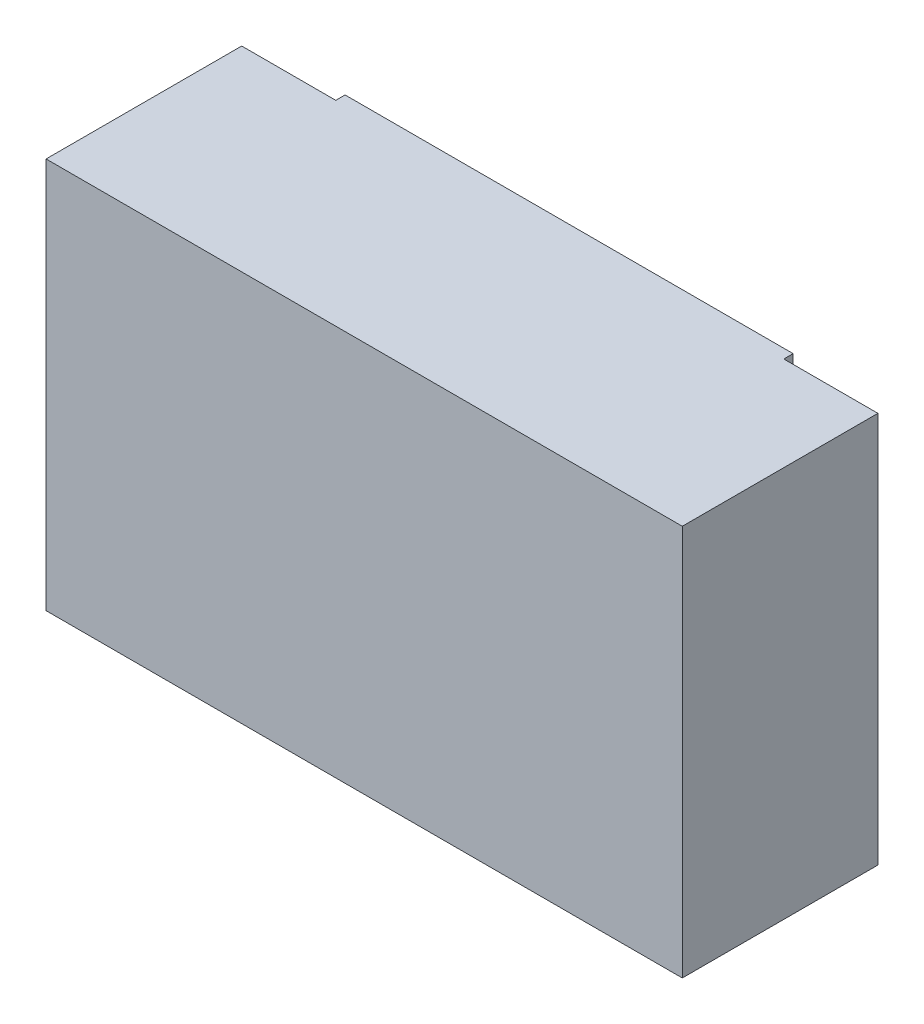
ISO-10303-21;
HEADER;
FILE_DESCRIPTION(('STEP AP214'),'2;1');
FILE_NAME('part.step','',(''),(''),'','','');
FILE_SCHEMA(('AUTOMOTIVE_DESIGN { 1 0 10303 214 1 1 1 1 }'));
ENDSEC;
DATA;
#1=APPLICATION_CONTEXT('core data for automotive mechanical design processes');
#2=APPLICATION_PROTOCOL_DEFINITION('international standard','automotive_design',2000,#1);
#3=PRODUCT_CONTEXT('',#1,'mechanical');
#4=PRODUCT('Part','Part','',(#3));
#5=PRODUCT_RELATED_PRODUCT_CATEGORY('part','',(#4));
#6=PRODUCT_DEFINITION_FORMATION('','',#4);
#7=PRODUCT_DEFINITION_CONTEXT('part definition',#1,'design');
#8=PRODUCT_DEFINITION('design','',#6,#7);
#9=PRODUCT_DEFINITION_SHAPE('','',#8);
#10=(LENGTH_UNIT() NAMED_UNIT(*) SI_UNIT(.MILLI.,.METRE.));
#11=(NAMED_UNIT(*) PLANE_ANGLE_UNIT() SI_UNIT($,.RADIAN.));
#12=(NAMED_UNIT(*) SI_UNIT($,.STERADIAN.) SOLID_ANGLE_UNIT());
#13=UNCERTAINTY_MEASURE_WITH_UNIT(LENGTH_MEASURE(1.E-05),#10,'distance_accuracy_value','');
#14=(GEOMETRIC_REPRESENTATION_CONTEXT(3) GLOBAL_UNCERTAINTY_ASSIGNED_CONTEXT((#13)) GLOBAL_UNIT_ASSIGNED_CONTEXT((#10,
#11,#12)) REPRESENTATION_CONTEXT('',''));
#15=CARTESIAN_POINT('',(0.,0.,0.));
#16=DIRECTION('',(0.,0.,1.));
#17=DIRECTION('',(1.,0.,0.));
#18=AXIS2_PLACEMENT_3D('',#15,#16,#17);
#19=CARTESIAN_POINT('',(35.092858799,-7.828970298,1.));
#20=DIRECTION('',(0.,0.,-1.));
#21=DIRECTION('',(-1.,0.,0.));
#22=AXIS2_PLACEMENT_3D('',#19,#20,#21);
#23=PLANE('',#22);
#24=DIRECTION('',(1.,0.,0.));
#25=VECTOR('',#24,1.);
#26=CARTESIAN_POINT('',(0.9428587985,34.171029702,0.999999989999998));
#27=LINE('',#26,#25);
#28=CARTESIAN_POINT('',(24.992858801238,34.171029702,0.999999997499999));
#29=VERTEX_POINT('',#28);
#30=CARTESIAN_POINT('',(35.092858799,34.171029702,0.9999999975));
#31=VERTEX_POINT('',#30);
#32=EDGE_CURVE('E90',#29,#31,#27,.T.);
#33=ORIENTED_EDGE('',*,*,#32,.T.);
#34=DIRECTION('',(0.,1.,0.));
#35=VECTOR('',#34,1.);
#36=CARTESIAN_POINT('',(35.092858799,13.171029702,1.));
#37=LINE('',#36,#35);
#38=CARTESIAN_POINT('',(35.092858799,-7.828970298,0.9999999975));
#39=VERTEX_POINT('',#38);
#40=EDGE_CURVE('E82',#39,#31,#37,.T.);
#41=ORIENTED_EDGE('',*,*,#40,.F.);
#42=DIRECTION('',(1.,0.,0.));
#43=VECTOR('',#42,1.);
#44=CARTESIAN_POINT('',(0.9428587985,-7.828970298,0.999999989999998));
#45=LINE('',#44,#43);
#46=CARTESIAN_POINT('',(24.992858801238,-7.828970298,0.999999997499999));
#47=VERTEX_POINT('',#46);
#48=EDGE_CURVE('E91',#47,#39,#45,.T.);
#49=ORIENTED_EDGE('',*,*,#48,.F.);
#50=DIRECTION('',(0.,-1.,0.));
#51=VECTOR('',#50,1.);
#52=CARTESIAN_POINT('',(24.992858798,13.171029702,1.));
#53=LINE('',#52,#51);
#54=EDGE_CURVE('E88',#29,#47,#53,.T.);
#55=ORIENTED_EDGE('',*,*,#54,.F.);
#56=EDGE_LOOP('',(#33,#41,#49,#55));
#57=FACE_BOUND('',#56,.T.);
#58=ADVANCED_FACE('F17',(#57),#23,.T.);
#59=CARTESIAN_POINT('',(35.092858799,-7.828970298,22.));
#60=DIRECTION('',(1.,0.,0.));
#61=DIRECTION('',(0.,0.,-1.));
#62=AXIS2_PLACEMENT_3D('',#59,#60,#61);
#63=PLANE('',#62);
#64=DIRECTION('',(0.,0.,1.));
#65=VECTOR('',#64,1.);
#66=CARTESIAN_POINT('',(35.092858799,34.171029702,11.));
#67=LINE('',#66,#65);
#68=CARTESIAN_POINT('',(35.092858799,34.171029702,22.));
#69=VERTEX_POINT('',#68);
#70=EDGE_CURVE('E105',#31,#69,#67,.T.);
#71=ORIENTED_EDGE('',*,*,#70,.T.);
#72=DIRECTION('',(0.,1.,0.));
#73=VECTOR('',#72,1.);
#74=CARTESIAN_POINT('',(35.092858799,13.171029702,22.));
#75=LINE('',#74,#73);
#76=CARTESIAN_POINT('',(35.092858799,-7.828970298,22.));
#77=VERTEX_POINT('',#76);
#78=EDGE_CURVE('E117',#77,#69,#75,.T.);
#79=ORIENTED_EDGE('',*,*,#78,.F.);
#80=DIRECTION('',(0.,0.,1.));
#81=VECTOR('',#80,1.);
#82=CARTESIAN_POINT('',(35.092858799,-7.828970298,11.));
#83=LINE('',#82,#81);
#84=EDGE_CURVE('E151',#39,#77,#83,.T.);
#85=ORIENTED_EDGE('',*,*,#84,.F.);
#86=ORIENTED_EDGE('',*,*,#40,.T.);
#87=EDGE_LOOP('',(#71,#79,#85,#86));
#88=FACE_BOUND('',#87,.T.);
#89=ADVANCED_FACE('F169',(#88),#63,.T.);
#90=CARTESIAN_POINT('',(-33.207141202,-7.828970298,22.));
#91=DIRECTION('',(0.,0.,1.));
#92=DIRECTION('',(1.,0.,0.));
#93=AXIS2_PLACEMENT_3D('',#90,#91,#92);
#94=PLANE('',#93);
#95=DIRECTION('',(-1.,0.,0.));
#96=VECTOR('',#95,1.);
#97=CARTESIAN_POINT('',(0.9428587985,-7.828970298,22.));
#98=LINE('',#97,#96);
#99=CARTESIAN_POINT('',(-33.207141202,-7.828970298,22.));
#100=VERTEX_POINT('',#99);
#101=EDGE_CURVE('E145',#77,#100,#98,.T.);
#102=ORIENTED_EDGE('',*,*,#101,.F.);
#103=ORIENTED_EDGE('',*,*,#78,.T.);
#104=DIRECTION('',(-1.,0.,0.));
#105=VECTOR('',#104,1.);
#106=CARTESIAN_POINT('',(0.9428587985,34.171029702,22.));
#107=LINE('',#106,#105);
#108=CARTESIAN_POINT('',(-33.207141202,34.171029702,22.));
#109=VERTEX_POINT('',#108);
#110=EDGE_CURVE('E166',#69,#109,#107,.T.);
#111=ORIENTED_EDGE('',*,*,#110,.T.);
#112=DIRECTION('',(0.,-1.,0.));
#113=VECTOR('',#112,1.);
#114=CARTESIAN_POINT('',(-33.207141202,13.171029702,22.));
#115=LINE('',#114,#113);
#116=EDGE_CURVE('E114',#109,#100,#115,.T.);
#117=ORIENTED_EDGE('',*,*,#116,.T.);
#118=EDGE_LOOP('',(#102,#103,#111,#117));
#119=FACE_BOUND('',#118,.T.);
#120=ADVANCED_FACE('F172',(#119),#94,.T.);
#121=CARTESIAN_POINT('',(-33.207141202,-7.828970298,22.));
#122=DIRECTION('',(1.,0.,0.));
#123=DIRECTION('',(0.,0.,-1.));
#124=AXIS2_PLACEMENT_3D('',#121,#122,#123);
#125=PLANE('',#124);
#126=DIRECTION('',(0.,0.,-1.));
#127=VECTOR('',#126,1.);
#128=CARTESIAN_POINT('',(-33.207141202,-7.828970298,11.));
#129=LINE('',#128,#127);
#130=CARTESIAN_POINT('',(-33.207141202,-7.828970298,0.9999999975));
#131=VERTEX_POINT('',#130);
#132=EDGE_CURVE('E142',#100,#131,#129,.T.);
#133=ORIENTED_EDGE('',*,*,#132,.F.);
#134=ORIENTED_EDGE('',*,*,#116,.F.);
#135=DIRECTION('',(0.,0.,-1.));
#136=VECTOR('',#135,1.);
#137=CARTESIAN_POINT('',(-33.207141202,34.171029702,11.));
#138=LINE('',#137,#136);
#139=CARTESIAN_POINT('',(-33.207141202,34.171029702,0.9999999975));
#140=VERTEX_POINT('',#139);
#141=EDGE_CURVE('E163',#109,#140,#138,.T.);
#142=ORIENTED_EDGE('',*,*,#141,.T.);
#143=DIRECTION('',(0.,1.,0.));
#144=VECTOR('',#143,1.);
#145=CARTESIAN_POINT('',(-33.207141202,13.171029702,1.));
#146=LINE('',#145,#144);
#147=EDGE_CURVE('E97',#131,#140,#146,.T.);
#148=ORIENTED_EDGE('',*,*,#147,.F.);
#149=EDGE_LOOP('',(#133,#134,#142,#148));
#150=FACE_BOUND('',#149,.T.);
#151=ADVANCED_FACE('F191',(#150),#125,.F.);
#152=CARTESIAN_POINT('',(-23.107141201,-7.828970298,1.));
#153=DIRECTION('',(0.,0.,-1.));
#154=DIRECTION('',(-1.,0.,0.));
#155=AXIS2_PLACEMENT_3D('',#152,#153,#154);
#156=PLANE('',#155);
#157=DIRECTION('',(0.,-1.,0.));
#158=VECTOR('',#157,1.);
#159=CARTESIAN_POINT('',(-23.107141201,13.171029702,1.));
#160=LINE('',#159,#158);
#161=CARTESIAN_POINT('',(-23.1071412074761,34.171029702,0.999999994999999));
#162=VERTEX_POINT('',#161);
#163=CARTESIAN_POINT('',(-23.107141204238,-7.828970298,0.999999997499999));
#164=VERTEX_POINT('',#163);
#165=EDGE_CURVE('E157',#162,#164,#160,.T.);
#166=ORIENTED_EDGE('',*,*,#165,.T.);
#167=DIRECTION('',(1.,0.,0.));
#168=VECTOR('',#167,1.);
#169=CARTESIAN_POINT('',(0.9428587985,-7.828970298,0.999999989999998));
#170=LINE('',#169,#168);
#171=EDGE_CURVE('E139',#131,#164,#170,.T.);
#172=ORIENTED_EDGE('',*,*,#171,.F.);
#173=ORIENTED_EDGE('',*,*,#147,.T.);
#174=DIRECTION('',(1.,0.,0.));
#175=VECTOR('',#174,1.);
#176=CARTESIAN_POINT('',(0.9428587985,34.171029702,0.999999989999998));
#177=LINE('',#176,#175);
#178=EDGE_CURVE('E161',#140,#162,#177,.T.);
#179=ORIENTED_EDGE('',*,*,#178,.T.);
#180=EDGE_LOOP('',(#166,#172,#173,#179));
#181=FACE_BOUND('',#180,.T.);
#182=ADVANCED_FACE('F188',(#181),#156,.T.);
#183=CARTESIAN_POINT('',(14.918858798,-4.852970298,10.));
#184=DIRECTION('',(0.,0.,1.));
#185=DIRECTION('',(1.,0.,0.));
#186=AXIS2_PLACEMENT_3D('',#183,#184,#185);
#187=PLANE('',#186);
#188=CARTESIAN_POINT('',(16.942858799,-2.828970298,10.));
#189=DIRECTION('',(0.,0.,-1.));
#190=DIRECTION('',(0.,1.,0.));
#191=AXIS2_PLACEMENT_3D('',#188,#189,#190);
#192=CIRCLE('',#191,2.000000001);
#193=CARTESIAN_POINT('',(16.942858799,-0.828970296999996,10.));
#194=VERTEX_POINT('',#193);
#195=EDGE_CURVE('E21',#194,#194,#192,.F.);
#196=ORIENTED_EDGE('',*,*,#195,.F.);
#197=EDGE_LOOP('',(#196));
#198=FACE_BOUND('',#197,.T.);
#199=ADVANCED_FACE('F199',(#198),#187,.F.);
#200=CARTESIAN_POINT('',(-17.081141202,-4.852970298,10.));
#201=DIRECTION('',(0.,0.,1.));
#202=DIRECTION('',(1.,0.,0.));
#203=AXIS2_PLACEMENT_3D('',#200,#201,#202);
#204=PLANE('',#203);
#205=CARTESIAN_POINT('',(-15.057141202,-2.828970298,10.));
#206=DIRECTION('',(0.,0.,-1.));
#207=DIRECTION('',(0.,1.,0.));
#208=AXIS2_PLACEMENT_3D('',#205,#206,#207);
#209=CIRCLE('',#208,2.);
#210=CARTESIAN_POINT('',(-15.057141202,-0.828970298,10.));
#211=VERTEX_POINT('',#210);
#212=EDGE_CURVE('E134',#211,#211,#209,.F.);
#213=ORIENTED_EDGE('',*,*,#212,.F.);
#214=EDGE_LOOP('',(#213));
#215=FACE_BOUND('',#214,.T.);
#216=ADVANCED_FACE('F260',(#215),#204,.F.);
#217=CARTESIAN_POINT('',(-17.081141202,27.147029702,10.));
#218=DIRECTION('',(0.,0.,1.));
#219=DIRECTION('',(1.,0.,0.));
#220=AXIS2_PLACEMENT_3D('',#217,#218,#219);
#221=PLANE('',#220);
#222=CARTESIAN_POINT('',(-15.057141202,29.171029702,10.));
#223=DIRECTION('',(0.,0.,-1.));
#224=DIRECTION('',(0.,1.,0.));
#225=AXIS2_PLACEMENT_3D('',#222,#223,#224);
#226=CIRCLE('',#225,2.);
#227=CARTESIAN_POINT('',(-15.057141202,31.171029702,10.));
#228=VERTEX_POINT('',#227);
#229=EDGE_CURVE('E132',#228,#228,#226,.F.);
#230=ORIENTED_EDGE('',*,*,#229,.F.);
#231=EDGE_LOOP('',(#230));
#232=FACE_BOUND('',#231,.T.);
#233=ADVANCED_FACE('F270',(#232),#221,.F.);
#234=CARTESIAN_POINT('',(24.992858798,-7.828970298,1.));
#235=DIRECTION('',(1.,0.,0.));
#236=DIRECTION('',(0.,0.,-1.));
#237=AXIS2_PLACEMENT_3D('',#234,#235,#236);
#238=PLANE('',#237);
#239=ORIENTED_EDGE('',*,*,#54,.T.);
#240=DIRECTION('',(0.,0.,1.));
#241=VECTOR('',#240,1.);
#242=CARTESIAN_POINT('',(24.9928588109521,-7.828970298,11.));
#243=LINE('',#242,#241);
#244=CARTESIAN_POINT('',(24.992858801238,-7.828970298,0.));
#245=VERTEX_POINT('',#244);
#246=EDGE_CURVE('E154',#245,#47,#243,.T.);
#247=ORIENTED_EDGE('',*,*,#246,.F.);
#248=DIRECTION('',(0.,1.,0.));
#249=VECTOR('',#248,1.);
#250=CARTESIAN_POINT('',(24.992858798,13.171029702,0.));
#251=LINE('',#250,#249);
#252=CARTESIAN_POINT('',(24.992858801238,34.171029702,0.));
#253=VERTEX_POINT('',#252);
#254=EDGE_CURVE('E109',#245,#253,#251,.T.);
#255=ORIENTED_EDGE('',*,*,#254,.T.);
#256=DIRECTION('',(0.,0.,1.));
#257=VECTOR('',#256,1.);
#258=CARTESIAN_POINT('',(24.9928588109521,34.171029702,11.));
#259=LINE('',#258,#257);
#260=EDGE_CURVE('E96',#253,#29,#259,.T.);
#261=ORIENTED_EDGE('',*,*,#260,.T.);
#262=EDGE_LOOP('',(#239,#247,#255,#261));
#263=FACE_BOUND('',#262,.T.);
#264=ADVANCED_FACE('F108',(#263),#238,.T.);
#265=CARTESIAN_POINT('',(-33.207141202,34.171029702,22.));
#266=DIRECTION('',(0.,-1.,0.));
#267=DIRECTION('',(0.,0.,-1.));
#268=AXIS2_PLACEMENT_3D('',#265,#266,#267);
#269=PLANE('',#268);
#270=DIRECTION('',(0.,0.,1.));
#271=VECTOR('',#270,1.);
#272=CARTESIAN_POINT('',(-23.107141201,34.171029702,0.5));
#273=LINE('',#272,#271);
#274=CARTESIAN_POINT('',(-23.1071412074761,34.171029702,0.));
#275=VERTEX_POINT('',#274);
#276=EDGE_CURVE('E159',#275,#162,#273,.T.);
#277=ORIENTED_EDGE('',*,*,#276,.T.);
#278=ORIENTED_EDGE('',*,*,#178,.F.);
#279=ORIENTED_EDGE('',*,*,#141,.F.);
#280=ORIENTED_EDGE('',*,*,#110,.F.);
#281=ORIENTED_EDGE('',*,*,#70,.F.);
#282=ORIENTED_EDGE('',*,*,#32,.F.);
#283=ORIENTED_EDGE('',*,*,#260,.F.);
#284=DIRECTION('',(-1.,0.,0.));
#285=VECTOR('',#284,1.);
#286=CARTESIAN_POINT('',(0.942858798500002,34.171029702,0.));
#287=LINE('',#286,#285);
#288=EDGE_CURVE('E181',#253,#275,#287,.T.);
#289=ORIENTED_EDGE('',*,*,#288,.T.);
#290=EDGE_LOOP('',(#277,#278,#279,#280,#281,#282,#283,#289));
#291=FACE_BOUND('',#290,.T.);
#292=ADVANCED_FACE('F101',(#291),#269,.F.);
#293=CARTESIAN_POINT('',(-23.107141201,-7.828970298,1.));
#294=DIRECTION('',(1.,0.,0.));
#295=DIRECTION('',(0.,0.,-1.));
#296=AXIS2_PLACEMENT_3D('',#293,#294,#295);
#297=PLANE('',#296);
#298=ORIENTED_EDGE('',*,*,#165,.F.);
#299=ORIENTED_EDGE('',*,*,#276,.F.);
#300=DIRECTION('',(0.,-1.,0.));
#301=VECTOR('',#300,1.);
#302=CARTESIAN_POINT('',(-23.107141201,13.171029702,0.));
#303=LINE('',#302,#301);
#304=CARTESIAN_POINT('',(-23.107141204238,-7.828970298,0.));
#305=VERTEX_POINT('',#304);
#306=EDGE_CURVE('E179',#275,#305,#303,.T.);
#307=ORIENTED_EDGE('',*,*,#306,.T.);
#308=DIRECTION('',(0.,0.,-1.));
#309=VECTOR('',#308,1.);
#310=CARTESIAN_POINT('',(-23.1071412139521,-7.828970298,11.));
#311=LINE('',#310,#309);
#312=EDGE_CURVE('E36',#164,#305,#311,.T.);
#313=ORIENTED_EDGE('',*,*,#312,.F.);
#314=EDGE_LOOP('',(#298,#299,#307,#313));
#315=FACE_BOUND('',#314,.T.);
#316=ADVANCED_FACE('F186',(#315),#297,.F.);
#317=CARTESIAN_POINT('',(-33.207141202,-7.828970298,22.));
#318=DIRECTION('',(0.,-1.,0.));
#319=DIRECTION('',(0.,0.,-1.));
#320=AXIS2_PLACEMENT_3D('',#317,#318,#319);
#321=PLANE('',#320);
#322=ORIENTED_EDGE('',*,*,#132,.T.);
#323=ORIENTED_EDGE('',*,*,#171,.T.);
#324=ORIENTED_EDGE('',*,*,#312,.T.);
#325=DIRECTION('',(1.,0.,0.));
#326=VECTOR('',#325,1.);
#327=CARTESIAN_POINT('',(0.942858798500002,-7.828970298,0.));
#328=LINE('',#327,#326);
#329=EDGE_CURVE('E131',#305,#245,#328,.T.);
#330=ORIENTED_EDGE('',*,*,#329,.T.);
#331=ORIENTED_EDGE('',*,*,#246,.T.);
#332=ORIENTED_EDGE('',*,*,#48,.T.);
#333=ORIENTED_EDGE('',*,*,#84,.T.);
#334=ORIENTED_EDGE('',*,*,#101,.T.);
#335=EDGE_LOOP('',(#322,#323,#324,#330,#331,#332,#333,#334));
#336=FACE_BOUND('',#335,.T.);
#337=ADVANCED_FACE('F174',(#336),#321,.T.);
#338=CARTESIAN_POINT('',(16.942858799,-2.828970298,10.));
#339=DIRECTION('',(0.,0.,-1.));
#340=DIRECTION('',(0.,1.,0.));
#341=AXIS2_PLACEMENT_3D('',#338,#339,#340);
#342=CYLINDRICAL_SURFACE('',#341,2.000000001);
#343=CARTESIAN_POINT('',(16.942858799,-2.828970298,0.));
#344=DIRECTION('',(0.,0.,-1.));
#345=DIRECTION('',(0.,1.,0.));
#346=AXIS2_PLACEMENT_3D('',#343,#344,#345);
#347=CIRCLE('',#346,2.000000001);
#348=CARTESIAN_POINT('',(16.942858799,-0.828970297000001,0.));
#349=VERTEX_POINT('',#348);
#350=EDGE_CURVE('E128',#349,#349,#347,.T.);
#351=ORIENTED_EDGE('',*,*,#350,.T.);
#352=EDGE_LOOP('',(#351));
#353=FACE_BOUND('',#352,.T.);
#354=ORIENTED_EDGE('',*,*,#195,.T.);
#355=EDGE_LOOP('',(#354));
#356=FACE_BOUND('',#355,.T.);
#357=ADVANCED_FACE('F220',(#353,#356),#342,.F.);
#358=CARTESIAN_POINT('',(-15.057141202,-2.828970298,10.));
#359=DIRECTION('',(0.,0.,-1.));
#360=DIRECTION('',(0.,1.,0.));
#361=AXIS2_PLACEMENT_3D('',#358,#359,#360);
#362=CYLINDRICAL_SURFACE('',#361,2.);
#363=CARTESIAN_POINT('',(-15.057141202,-2.828970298,0.));
#364=DIRECTION('',(0.,0.,-1.));
#365=DIRECTION('',(0.,1.,0.));
#366=AXIS2_PLACEMENT_3D('',#363,#364,#365);
#367=CIRCLE('',#366,2.);
#368=CARTESIAN_POINT('',(-15.057141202,-0.828970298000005,0.));
#369=VERTEX_POINT('',#368);
#370=EDGE_CURVE('E125',#369,#369,#367,.T.);
#371=ORIENTED_EDGE('',*,*,#370,.T.);
#372=EDGE_LOOP('',(#371));
#373=FACE_BOUND('',#372,.T.);
#374=ORIENTED_EDGE('',*,*,#212,.T.);
#375=EDGE_LOOP('',(#374));
#376=FACE_BOUND('',#375,.T.);
#377=ADVANCED_FACE('F216',(#373,#376),#362,.F.);
#378=CARTESIAN_POINT('',(-15.057141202,29.171029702,10.));
#379=DIRECTION('',(0.,0.,-1.));
#380=DIRECTION('',(0.,1.,0.));
#381=AXIS2_PLACEMENT_3D('',#378,#379,#380);
#382=CYLINDRICAL_SURFACE('',#381,2.);
#383=CARTESIAN_POINT('',(-15.057141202,29.171029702,0.));
#384=DIRECTION('',(0.,0.,-1.));
#385=DIRECTION('',(0.,1.,0.));
#386=AXIS2_PLACEMENT_3D('',#383,#384,#385);
#387=CIRCLE('',#386,2.);
#388=CARTESIAN_POINT('',(-15.057141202,31.171029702,0.));
#389=VERTEX_POINT('',#388);
#390=EDGE_CURVE('E122',#389,#389,#387,.T.);
#391=ORIENTED_EDGE('',*,*,#390,.T.);
#392=EDGE_LOOP('',(#391));
#393=FACE_BOUND('',#392,.T.);
#394=ORIENTED_EDGE('',*,*,#229,.T.);
#395=EDGE_LOOP('',(#394));
#396=FACE_BOUND('',#395,.T.);
#397=ADVANCED_FACE('F213',(#393,#396),#382,.F.);
#398=CARTESIAN_POINT('',(14.918858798,27.147029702,10.));
#399=DIRECTION('',(0.,0.,1.));
#400=DIRECTION('',(1.,0.,0.));
#401=AXIS2_PLACEMENT_3D('',#398,#399,#400);
#402=PLANE('',#401);
#403=CARTESIAN_POINT('',(16.942858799,29.171029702,10.));
#404=DIRECTION('',(0.,0.,-1.));
#405=DIRECTION('',(0.,1.,0.));
#406=AXIS2_PLACEMENT_3D('',#403,#404,#405);
#407=CIRCLE('',#406,2.000000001);
#408=CARTESIAN_POINT('',(16.942858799,31.171029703,10.));
#409=VERTEX_POINT('',#408);
#410=EDGE_CURVE('E27',#409,#409,#407,.F.);
#411=ORIENTED_EDGE('',*,*,#410,.F.);
#412=EDGE_LOOP('',(#411));
#413=FACE_BOUND('',#412,.T.);
#414=ADVANCED_FACE('F209',(#413),#402,.F.);
#415=CARTESIAN_POINT('',(-23.107141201,-7.828970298,0.));
#416=DIRECTION('',(0.,0.,1.));
#417=DIRECTION('',(1.,0.,0.));
#418=AXIS2_PLACEMENT_3D('',#415,#416,#417);
#419=PLANE('',#418);
#420=CARTESIAN_POINT('',(16.942858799,29.171029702,0.));
#421=DIRECTION('',(0.,0.,-1.));
#422=DIRECTION('',(0.,1.,0.));
#423=AXIS2_PLACEMENT_3D('',#420,#421,#422);
#424=CIRCLE('',#423,2.000000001);
#425=CARTESIAN_POINT('',(16.942858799,31.171029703,0.));
#426=VERTEX_POINT('',#425);
#427=EDGE_CURVE('E11',#426,#426,#424,.T.);
#428=ORIENTED_EDGE('',*,*,#427,.F.);
#429=EDGE_LOOP('',(#428));
#430=FACE_BOUND('',#429,.T.);
#431=ORIENTED_EDGE('',*,*,#390,.F.);
#432=EDGE_LOOP('',(#431));
#433=FACE_BOUND('',#432,.T.);
#434=ORIENTED_EDGE('',*,*,#370,.F.);
#435=EDGE_LOOP('',(#434));
#436=FACE_BOUND('',#435,.T.);
#437=ORIENTED_EDGE('',*,*,#350,.F.);
#438=EDGE_LOOP('',(#437));
#439=FACE_BOUND('',#438,.T.);
#440=ORIENTED_EDGE('',*,*,#306,.F.);
#441=ORIENTED_EDGE('',*,*,#288,.F.);
#442=ORIENTED_EDGE('',*,*,#254,.F.);
#443=ORIENTED_EDGE('',*,*,#329,.F.);
#444=EDGE_LOOP('',(#440,#441,#442,#443));
#445=FACE_BOUND('',#444,.T.);
#446=ADVANCED_FACE('F19',(#430,#433,#436,#439,#445),#419,.F.);
#447=CARTESIAN_POINT('',(16.942858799,29.171029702,10.));
#448=DIRECTION('',(0.,0.,-1.));
#449=DIRECTION('',(0.,1.,0.));
#450=AXIS2_PLACEMENT_3D('',#447,#448,#449);
#451=CYLINDRICAL_SURFACE('',#450,2.000000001);
#452=ORIENTED_EDGE('',*,*,#427,.T.);
#453=EDGE_LOOP('',(#452));
#454=FACE_BOUND('',#453,.T.);
#455=ORIENTED_EDGE('',*,*,#410,.T.);
#456=EDGE_LOOP('',(#455));
#457=FACE_BOUND('',#456,.T.);
#458=ADVANCED_FACE('F202',(#454,#457),#451,.F.);
#459=CLOSED_SHELL('',(#58,#89,#120,#151,#182,#199,#216,#233,#264,#292,#316,#337,#357,#377,#397,
#414,#446,#458));
#460=MANIFOLD_SOLID_BREP('B1',#459);
#461=ADVANCED_BREP_SHAPE_REPRESENTATION('',(#18,#460),#14);
#462=SHAPE_DEFINITION_REPRESENTATION(#9,#461);
ENDSEC;
END-ISO-10303-21;
